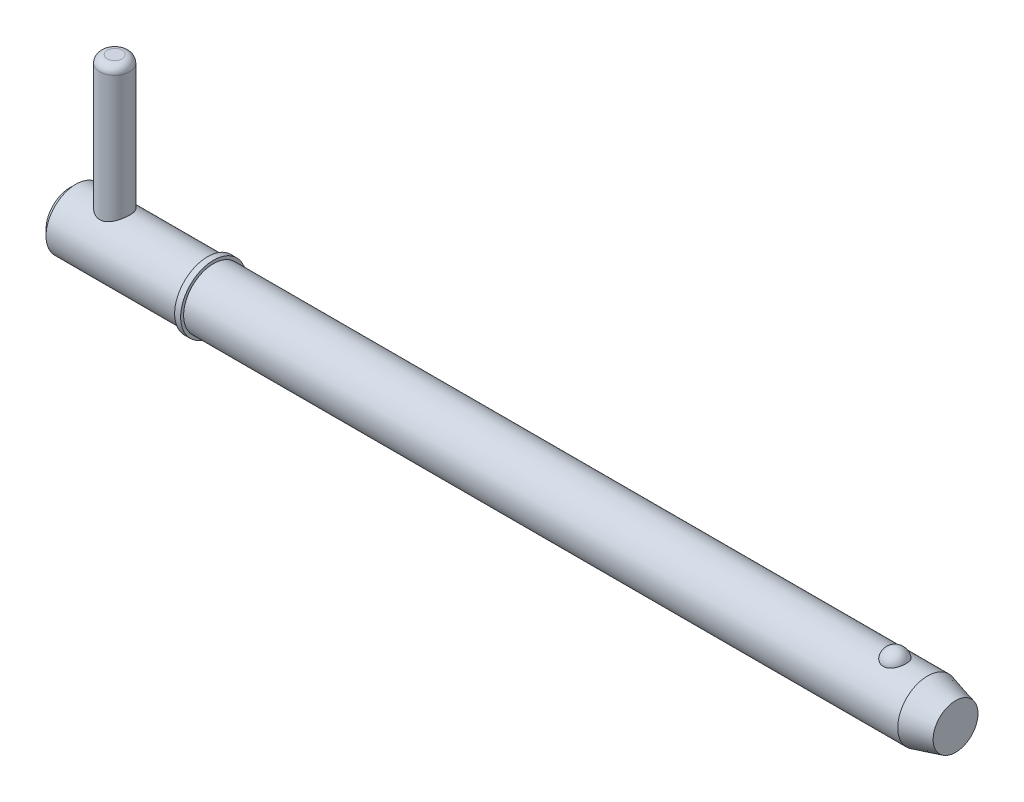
ISO-10303-21;
HEADER;
FILE_DESCRIPTION(('STEP AP214'),'2;1');
FILE_NAME('part.step','',(''),(''),'','','');
FILE_SCHEMA(('AUTOMOTIVE_DESIGN { 1 0 10303 214 1 1 1 1 }'));
ENDSEC;
DATA;
#1=APPLICATION_CONTEXT('core data for automotive mechanical design processes');
#2=APPLICATION_PROTOCOL_DEFINITION('international standard','automotive_design',2000,#1);
#3=PRODUCT_CONTEXT('',#1,'mechanical');
#4=PRODUCT('Part','Part','',(#3));
#5=PRODUCT_RELATED_PRODUCT_CATEGORY('part','',(#4));
#6=PRODUCT_DEFINITION_FORMATION('','',#4);
#7=PRODUCT_DEFINITION_CONTEXT('part definition',#1,'design');
#8=PRODUCT_DEFINITION('design','',#6,#7);
#9=PRODUCT_DEFINITION_SHAPE('','',#8);
#10=(LENGTH_UNIT() NAMED_UNIT(*) SI_UNIT(.MILLI.,.METRE.));
#11=(NAMED_UNIT(*) PLANE_ANGLE_UNIT() SI_UNIT($,.RADIAN.));
#12=(NAMED_UNIT(*) SI_UNIT($,.STERADIAN.) SOLID_ANGLE_UNIT());
#13=UNCERTAINTY_MEASURE_WITH_UNIT(LENGTH_MEASURE(1.E-05),#10,'distance_accuracy_value','');
#14=(GEOMETRIC_REPRESENTATION_CONTEXT(3) GLOBAL_UNCERTAINTY_ASSIGNED_CONTEXT((#13)) GLOBAL_UNIT_ASSIGNED_CONTEXT((#10,
#11,#12)) REPRESENTATION_CONTEXT('',''));
#15=CARTESIAN_POINT('',(0.,0.,0.));
#16=DIRECTION('',(0.,0.,1.));
#17=DIRECTION('',(1.,0.,0.));
#18=AXIS2_PLACEMENT_3D('',#15,#16,#17);
#19=CARTESIAN_POINT('',(5.94,21.43,0.));
#20=DIRECTION('',(0.,-1.,0.));
#21=DIRECTION('',(0.,0.,-1.));
#22=AXIS2_PLACEMENT_3D('',#19,#20,#21);
#23=CYLINDRICAL_SURFACE('',#22,1.98);
#24=CARTESIAN_POINT('',(5.94,-2.98,0.));
#25=DIRECTION('',(0.,1.,0.));
#26=DIRECTION('',(0.,0.,1.));
#27=AXIS2_PLACEMENT_3D('',#24,#25,#26);
#28=CIRCLE('',#27,1.98);
#29=CARTESIAN_POINT('',(5.94,-2.98,1.98));
#30=VERTEX_POINT('',#29);
#31=EDGE_CURVE('P0_E25',#30,#30,#28,.T.);
#32=ORIENTED_EDGE('',*,*,#31,.T.);
#33=EDGE_LOOP('',(#32));
#34=FACE_BOUND('',#33,.T.);
#35=CARTESIAN_POINT('',(5.94,20.44,0.));
#36=DIRECTION('',(0.,1.,0.));
#37=DIRECTION('',(0.,0.,1.));
#38=AXIS2_PLACEMENT_3D('',#35,#36,#37);
#39=CIRCLE('',#38,1.98);
#40=CARTESIAN_POINT('',(5.94,20.44,1.98));
#41=VERTEX_POINT('',#40);
#42=EDGE_CURVE('P0_E29',#41,#41,#39,.F.);
#43=ORIENTED_EDGE('',*,*,#42,.T.);
#44=EDGE_LOOP('',(#43));
#45=FACE_BOUND('',#44,.T.);
#46=ADVANCED_FACE('P0_F14',(#34,#45),#23,.T.);
#47=CARTESIAN_POINT('',(5.94,21.43,0.));
#48=DIRECTION('',(0.,1.,0.));
#49=DIRECTION('',(0.,0.,1.));
#50=AXIS2_PLACEMENT_3D('',#47,#48,#49);
#51=PLANE('',#50);
#52=CARTESIAN_POINT('',(5.94,21.43,0.));
#53=DIRECTION('',(0.,1.,0.));
#54=DIRECTION('',(0.,0.,1.));
#55=AXIS2_PLACEMENT_3D('',#52,#53,#54);
#56=CIRCLE('',#55,0.99);
#57=CARTESIAN_POINT('',(5.94,21.43,0.99));
#58=VERTEX_POINT('',#57);
#59=EDGE_CURVE('P0_E10',#58,#58,#56,.T.);
#60=ORIENTED_EDGE('',*,*,#59,.T.);
#61=EDGE_LOOP('',(#60));
#62=FACE_BOUND('',#61,.T.);
#63=ADVANCED_FACE('P0_F46',(#62),#51,.T.);
#64=CARTESIAN_POINT('',(5.94,-3.97,0.));
#65=DIRECTION('',(0.,1.,0.));
#66=DIRECTION('',(0.,0.,1.));
#67=AXIS2_PLACEMENT_3D('',#64,#65,#66);
#68=PLANE('',#67);
#69=CARTESIAN_POINT('',(5.94,-3.97,0.));
#70=DIRECTION('',(0.,1.,0.));
#71=DIRECTION('',(0.,0.,1.));
#72=AXIS2_PLACEMENT_3D('',#69,#70,#71);
#73=CIRCLE('',#72,0.99);
#74=CARTESIAN_POINT('',(5.94,-3.97,0.99));
#75=VERTEX_POINT('',#74);
#76=EDGE_CURVE('P0_E21',#75,#75,#73,.F.);
#77=ORIENTED_EDGE('',*,*,#76,.T.);
#78=EDGE_LOOP('',(#77));
#79=FACE_BOUND('',#78,.T.);
#80=ADVANCED_FACE('P0_F43',(#79),#68,.F.);
#81=CARTESIAN_POINT('',(5.94,-2.98,0.));
#82=DIRECTION('',(0.,1.,0.));
#83=DIRECTION('',(0.,0.,1.));
#84=AXIS2_PLACEMENT_3D('',#81,#82,#83);
#85=DEGENERATE_TOROIDAL_SURFACE('',#84,0.99,0.99,.T.);
#86=ORIENTED_EDGE('',*,*,#76,.F.);
#87=EDGE_LOOP('',(#86));
#88=FACE_BOUND('',#87,.T.);
#89=ORIENTED_EDGE('',*,*,#31,.F.);
#90=EDGE_LOOP('',(#89));
#91=FACE_BOUND('',#90,.T.);
#92=ADVANCED_FACE('P0_F38',(#88,#91),#85,.T.);
#93=CARTESIAN_POINT('',(5.94,20.44,0.));
#94=DIRECTION('',(0.,1.,0.));
#95=DIRECTION('',(0.,0.,1.));
#96=AXIS2_PLACEMENT_3D('',#93,#94,#95);
#97=DEGENERATE_TOROIDAL_SURFACE('',#96,0.99,0.99,.T.);
#98=ORIENTED_EDGE('',*,*,#42,.F.);
#99=EDGE_LOOP('',(#98));
#100=FACE_BOUND('',#99,.T.);
#101=ORIENTED_EDGE('',*,*,#59,.F.);
#102=EDGE_LOOP('',(#101));
#103=FACE_BOUND('',#102,.T.);
#104=ADVANCED_FACE('P0_F16',(#100,#103),#97,.T.);
#105=CLOSED_SHELL('',(#46,#63,#80,#92,#104));
#106=MANIFOLD_SOLID_BREP('P0_B1',#105);
#107=CARTESIAN_POINT('',(0.,0.,0.));
#108=DIRECTION('',(1.,0.,0.));
#109=DIRECTION('',(0.,0.,-1.));
#110=AXIS2_PLACEMENT_3D('',#107,#108,#109);
#111=CYLINDRICAL_SURFACE('',#110,3.97);
#112=CARTESIAN_POINT('',(113.775939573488,0.,0.));
#113=DIRECTION('',(1.,0.,0.));
#114=DIRECTION('',(0.,0.,-1.));
#115=AXIS2_PLACEMENT_3D('',#112,#113,#114);
#116=CIRCLE('',#115,3.97);
#117=CARTESIAN_POINT('',(113.775939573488,0.,-3.97));
#118=VERTEX_POINT('',#117);
#119=EDGE_CURVE('P1_E81',#118,#118,#116,.T.);
#120=ORIENTED_EDGE('',*,*,#119,.F.);
#121=EDGE_LOOP('',(#120));
#122=FACE_BOUND('',#121,.T.);
#123=CARTESIAN_POINT('',(19.05,0.,0.));
#124=DIRECTION('',(1.,0.,0.));
#125=DIRECTION('',(0.,0.,-1.));
#126=AXIS2_PLACEMENT_3D('',#123,#124,#125);
#127=CIRCLE('',#126,3.97);
#128=CARTESIAN_POINT('',(19.05,0.,-3.97));
#129=VERTEX_POINT('',#128);
#130=EDGE_CURVE('P1_E85',#129,#129,#127,.T.);
#131=ORIENTED_EDGE('',*,*,#130,.T.);
#132=EDGE_LOOP('',(#131));
#133=FACE_BOUND('',#132,.T.);
#134=CARTESIAN_POINT('',(109.445192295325,3.65715365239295,1.54470941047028));
#135=CARTESIAN_POINT('',(109.365244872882,3.65716001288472,1.54470290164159));
#136=CARTESIAN_POINT('',(109.285165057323,3.65987074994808,1.53832549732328));
#137=CARTESIAN_POINT('',(109.127237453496,3.6704221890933,1.51297018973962));
#138=CARTESIAN_POINT('',(109.04939614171,3.67827646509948,1.49395894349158));
#139=CARTESIAN_POINT('',(108.898461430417,3.69818848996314,1.44395950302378));
#140=CARTESIAN_POINT('',(108.825356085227,3.71023513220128,1.41300293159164));
#141=CARTESIAN_POINT('',(108.685563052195,3.73721833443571,1.34000212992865));
#142=CARTESIAN_POINT('',(108.618872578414,3.75215363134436,1.2979627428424));
#143=CARTESIAN_POINT('',(108.49148864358,3.78384968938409,1.20248834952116));
#144=CARTESIAN_POINT('',(108.431029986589,3.80065129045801,1.14875388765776));
#145=CARTESIAN_POINT('',(108.319694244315,3.83398532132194,1.03205417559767));
#146=CARTESIAN_POINT('',(108.268820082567,3.85051766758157,0.969086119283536));
#147=CARTESIAN_POINT('',(108.175632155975,3.88238608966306,0.832526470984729));
#148=CARTESIAN_POINT('',(108.133796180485,3.89763698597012,0.758588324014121));
#149=CARTESIAN_POINT('',(108.06251087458,3.92451063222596,0.60435211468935));
#150=CARTESIAN_POINT('',(108.033062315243,3.93613315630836,0.524053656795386));
#151=CARTESIAN_POINT('',(107.986892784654,3.95467606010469,0.358403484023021));
#152=CARTESIAN_POINT('',(107.970312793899,3.96154426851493,0.273006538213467));
#153=CARTESIAN_POINT('',(107.950756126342,3.96967008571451,0.100408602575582));
#154=CARTESIAN_POINT('',(107.947778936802,3.97092790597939,0.0132076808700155));
#155=CARTESIAN_POINT('',(107.955458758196,3.96771794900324,-0.159844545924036));
#156=CARTESIAN_POINT('',(107.966016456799,3.96329187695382,-0.245701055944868));
#157=CARTESIAN_POINT('',(108.00038009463,3.94923163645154,-0.41427746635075));
#158=CARTESIAN_POINT('',(108.024186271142,3.93959737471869,-0.496997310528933));
#159=CARTESIAN_POINT('',(108.08461142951,3.91607752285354,-0.657113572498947));
#160=CARTESIAN_POINT('',(108.121249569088,3.90218558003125,-0.734501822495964));
#161=CARTESIAN_POINT('',(108.206593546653,3.87158287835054,-0.881704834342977));
#162=CARTESIAN_POINT('',(108.255300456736,3.8548718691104,-0.951518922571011));
#163=CARTESIAN_POINT('',(108.364116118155,3.82028735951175,-1.08208159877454));
#164=CARTESIAN_POINT('',(108.424295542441,3.80240713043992,-1.14276958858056));
#165=CARTESIAN_POINT('',(108.554493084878,3.76758161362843,-1.2528243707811));
#166=CARTESIAN_POINT('',(108.624510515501,3.75063626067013,-1.30219195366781));
#167=CARTESIAN_POINT('',(108.77118160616,3.71998948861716,-1.38729709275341));
#168=CARTESIAN_POINT('',(108.847681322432,3.70623183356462,-1.42327904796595));
#169=CARTESIAN_POINT('',(109.006298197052,3.68323188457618,-1.48178996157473));
#170=CARTESIAN_POINT('',(109.0884132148,3.67398788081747,-1.5043240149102));
#171=CARTESIAN_POINT('',(109.251481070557,3.6615216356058,-1.53440939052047));
#172=CARTESIAN_POINT('',(109.332284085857,3.65801951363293,-1.54265826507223));
#173=CARTESIAN_POINT('',(109.49420850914,3.65657341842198,-1.54608423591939));
#174=CARTESIAN_POINT('',(109.575329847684,3.65862829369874,-1.54126404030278));
#175=CARTESIAN_POINT('',(109.732812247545,3.66788969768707,-1.51908474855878));
#176=CARTESIAN_POINT('',(109.809242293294,3.67492621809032,-1.50213925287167));
#177=CARTESIAN_POINT('',(109.958041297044,3.69318404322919,-1.45666982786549));
#178=CARTESIAN_POINT('',(110.030409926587,3.70440568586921,-1.42814496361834));
#179=CARTESIAN_POINT('',(110.170802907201,3.73012749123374,-1.35956319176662));
#180=CARTESIAN_POINT('',(110.238700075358,3.74469307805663,-1.31927107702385));
#181=CARTESIAN_POINT('',(110.366864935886,3.77545272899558,-1.22847440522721));
#182=CARTESIAN_POINT('',(110.427130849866,3.79164717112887,-1.17796747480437));
#183=CARTESIAN_POINT('',(110.541634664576,3.82490325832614,-1.06519260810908));
#184=CARTESIAN_POINT('',(110.595413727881,3.84196735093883,-1.00245914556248));
#185=CARTESIAN_POINT('',(110.692098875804,3.87439863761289,-0.868715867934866));
#186=CARTESIAN_POINT('',(110.735003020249,3.88976552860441,-0.797704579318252));
#187=CARTESIAN_POINT('',(110.810266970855,3.91771381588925,-0.646896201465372));
#188=CARTESIAN_POINT('',(110.84225322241,3.93019255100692,-0.566893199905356));
#189=CARTESIAN_POINT('',(110.893110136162,3.95043886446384,-0.402255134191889));
#190=CARTESIAN_POINT('',(110.911980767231,3.95820643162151,-0.317620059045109));
#191=CARTESIAN_POINT('',(110.93621625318,3.96823733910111,-0.146156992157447));
#192=CARTESIAN_POINT('',(110.941587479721,3.970503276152,-0.0593300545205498));
#193=CARTESIAN_POINT('',(110.938730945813,3.96930811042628,0.114057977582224));
#194=CARTESIAN_POINT('',(110.930503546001,3.9658471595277,0.200619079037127));
#195=CARTESIAN_POINT('',(110.900706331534,3.95358562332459,0.370506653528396));
#196=CARTESIAN_POINT('',(110.87921294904,3.94481563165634,0.453848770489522));
#197=CARTESIAN_POINT('',(110.82338397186,3.92284586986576,0.615497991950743));
#198=CARTESIAN_POINT('',(110.789047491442,3.90964579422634,0.693804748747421));
#199=CARTESIAN_POINT('',(110.707970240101,3.88006987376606,0.843703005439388));
#200=CARTESIAN_POINT('',(110.661153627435,3.86367478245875,0.915249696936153));
#201=CARTESIAN_POINT('',(110.556189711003,3.82949741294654,1.04910810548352));
#202=CARTESIAN_POINT('',(110.498042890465,3.81171519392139,1.11142021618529));
#203=CARTESIAN_POINT('',(110.371743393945,3.77673366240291,1.22503948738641));
#204=CARTESIAN_POINT('',(110.303597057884,3.75953398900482,1.27635357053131));
#205=CARTESIAN_POINT('',(110.158900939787,3.72770506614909,1.36653336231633));
#206=CARTESIAN_POINT('',(110.082348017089,3.71307678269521,1.40539439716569));
#207=CARTESIAN_POINT('',(109.925759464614,3.68864287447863,1.46830480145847));
#208=CARTESIAN_POINT('',(109.845930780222,3.67869017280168,1.49281289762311));
#209=CARTESIAN_POINT('',(109.682987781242,3.66414535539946,1.52817474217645));
#210=CARTESIAN_POINT('',(109.599884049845,3.65953723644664,1.53906926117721));
#211=CARTESIAN_POINT('',(109.492776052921,3.6573894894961,1.54414878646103));
#212=CARTESIAN_POINT('',(109.468990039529,3.65715175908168,1.54471134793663));
#213=CARTESIAN_POINT('',(109.445192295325,3.65715365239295,1.54470941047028));
#214=B_SPLINE_CURVE_WITH_KNOTS('',3,(#134,#135,#136,#137,#138,#139,#140,#141,#142,#143,#144,
#145,#146,#147,#148,#149,#150,#151,#152,#153,#154,#155,#156,#157,#158,#159,#160,#161,#162,#163,
#164,#165,#166,#167,#168,#169,#170,#171,#172,#173,#174,#175,#176,#177,#178,#179,#180,#181,#182,
#183,#184,#185,#186,#187,#188,#189,#190,#191,#192,#193,#194,#195,#196,#197,#198,#199,#200,#201,
#202,#203,#204,#205,#206,#207,#208,#209,#210,#211,#212,#213),.UNSPECIFIED.,.T.,.F.,(4,2,2,2,2,2,
2,2,2,2,2,2,2,2,2,2,2,2,2,2,2,2,2,2,2,2,2,2,2,2,2,2,2,2,2,2,2,2,2,4),(0.,0.239777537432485,
0.480190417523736,0.719971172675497,0.959647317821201,1.20639040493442,1.45320863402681,
1.7109367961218,1.96868099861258,2.22921052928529,2.48973023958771,2.74834928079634,
3.00697295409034,3.26598440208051,3.52501886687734,3.78570385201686,4.04637062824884,
4.30201257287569,4.5575576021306,4.80022994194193,5.04285200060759,5.27757006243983,
5.51230707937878,5.75210128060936,5.99195126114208,6.24392810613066,6.49594987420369,
6.75588818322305,7.01582710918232,7.27564332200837,7.53545264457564,7.79377886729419,
8.0521229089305,8.31207418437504,8.57201437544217,8.83179046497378,9.09166393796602,
9.34270057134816,9.59298357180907,9.66435753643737),.UNSPECIFIED.);
#215=CARTESIAN_POINT('',(109.445192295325,3.65715365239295,1.54470941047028));
#216=VERTEX_POINT('',#215);
#217=EDGE_CURVE('P1_E35',#216,#216,#214,.T.);
#218=ORIENTED_EDGE('',*,*,#217,.T.);
#219=EDGE_LOOP('',(#218));
#220=FACE_BOUND('',#219,.T.);
#221=ADVANCED_FACE('P1_F13',(#122,#133,#220),#111,.T.);
#222=CARTESIAN_POINT('',(0.,0.,0.));
#223=DIRECTION('',(-1.,0.,0.));
#224=DIRECTION('',(0.,0.,1.));
#225=AXIS2_PLACEMENT_3D('',#222,#223,#224);
#226=PLANE('',#225);
#227=CARTESIAN_POINT('',(0.,0.,0.));
#228=DIRECTION('',(1.,0.,0.));
#229=DIRECTION('',(0.,0.,-1.));
#230=AXIS2_PLACEMENT_3D('',#227,#228,#229);
#231=CIRCLE('',#230,3.176);
#232=CARTESIAN_POINT('',(0.,0.,-3.176));
#233=VERTEX_POINT('',#232);
#234=EDGE_CURVE('P1_E9',#233,#233,#231,.T.);
#235=ORIENTED_EDGE('',*,*,#234,.F.);
#236=EDGE_LOOP('',(#235));
#237=FACE_BOUND('',#236,.T.);
#238=ADVANCED_FACE('P1_F15',(#237),#226,.T.);
#239=CARTESIAN_POINT('',(0.793999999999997,0.,0.));
#240=DIRECTION('',(1.,0.,0.));
#241=DIRECTION('',(0.,0.,-1.));
#242=AXIS2_PLACEMENT_3D('',#239,#240,#241);
#243=CONICAL_SURFACE('',#242,3.97,0.78539816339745);
#244=ORIENTED_EDGE('',*,*,#234,.T.);
#245=EDGE_LOOP('',(#244));
#246=FACE_BOUND('',#245,.T.);
#247=CARTESIAN_POINT('',(0.793999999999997,0.,0.));
#248=DIRECTION('',(1.,0.,0.));
#249=DIRECTION('',(0.,0.,-1.));
#250=AXIS2_PLACEMENT_3D('',#247,#248,#249);
#251=CIRCLE('',#250,3.97);
#252=CARTESIAN_POINT('',(0.793999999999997,0.,-3.97));
#253=VERTEX_POINT('',#252);
#254=EDGE_CURVE('P1_E26',#253,#253,#251,.T.);
#255=ORIENTED_EDGE('',*,*,#254,.F.);
#256=EDGE_LOOP('',(#255));
#257=FACE_BOUND('',#256,.T.);
#258=ADVANCED_FACE('P1_F77',(#246,#257),#243,.T.);
#259=CARTESIAN_POINT('',(0.,0.,0.));
#260=DIRECTION('',(1.,0.,0.));
#261=DIRECTION('',(0.,0.,-1.));
#262=AXIS2_PLACEMENT_3D('',#259,#260,#261);
#263=CYLINDRICAL_SURFACE('',#262,3.97);
#264=CARTESIAN_POINT('',(5.94,-3.44100276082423,1.98));
#265=CARTESIAN_POINT('',(5.8367885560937,-3.44101282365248,1.97999171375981));
#266=CARTESIAN_POINT('',(5.73344176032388,-3.44571749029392,1.97187534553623));
#267=CARTESIAN_POINT('',(5.52991905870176,-3.46385873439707,1.93981946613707));
#268=CARTESIAN_POINT('',(5.42975031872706,-3.47731375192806,1.91584653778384));
#269=CARTESIAN_POINT('',(5.23590869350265,-3.51100678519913,1.85336773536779));
#270=CARTESIAN_POINT('',(5.14220446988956,-3.53120882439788,1.81493880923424));
#271=CARTESIAN_POINT('',(4.9625969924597,-3.57606420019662,1.72487335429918));
#272=CARTESIAN_POINT('',(4.87669412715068,-3.6007177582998,1.67323616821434));
#273=CARTESIAN_POINT('',(4.70734412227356,-3.65417020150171,1.55325205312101));
#274=CARTESIAN_POINT('',(4.62467662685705,-3.68314323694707,1.4838818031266));
#275=CARTESIAN_POINT('',(4.47154355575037,-3.74056406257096,1.33252902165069));
#276=CARTESIAN_POINT('',(4.40108404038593,-3.76901158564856,1.25054026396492));
#277=CARTESIAN_POINT('',(4.26974803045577,-3.82445556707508,1.06956584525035));
#278=CARTESIAN_POINT('',(4.20982960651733,-3.8512271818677,0.969809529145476));
#279=CARTESIAN_POINT('',(4.10798077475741,-3.89804342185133,0.760047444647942));
#280=CARTESIAN_POINT('',(4.06603907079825,-3.91809226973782,0.650048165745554));
#281=CARTESIAN_POINT('',(4.00441878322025,-3.94794912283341,0.431181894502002));
#282=CARTESIAN_POINT('',(3.98337329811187,-3.95838209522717,0.322786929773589));
#283=CARTESIAN_POINT('',(3.9596425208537,-3.97016407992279,0.103541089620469));
#284=CARTESIAN_POINT('',(3.95694618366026,-3.97151855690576,-0.00730826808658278));
#285=CARTESIAN_POINT('',(3.9694599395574,-3.96528826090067,-0.218044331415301));
#286=CARTESIAN_POINT('',(3.98314071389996,-3.95846689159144,-0.318049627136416));
#287=CARTESIAN_POINT('',(4.02528522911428,-3.93780347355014,-0.514124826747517));
#288=CARTESIAN_POINT('',(4.05375007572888,-3.92396089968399,-0.61019443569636));
#289=CARTESIAN_POINT('',(4.12484256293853,-3.89028355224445,-0.797351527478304));
#290=CARTESIAN_POINT('',(4.16766142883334,-3.87036821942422,-0.888351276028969));
#291=CARTESIAN_POINT('',(4.26598377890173,-3.82634285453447,-1.06209448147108));
#292=CARTESIAN_POINT('',(4.32149181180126,-3.8022313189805,-1.14483496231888));
#293=CARTESIAN_POINT('',(4.44962332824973,-3.74940011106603,-1.30802500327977));
#294=CARTESIAN_POINT('',(4.52336636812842,-3.72046031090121,-1.38752498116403));
#295=CARTESIAN_POINT('',(4.68287656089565,-3.66269463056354,-1.53354043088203));
#296=CARTESIAN_POINT('',(4.7686527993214,-3.63386885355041,-1.60004599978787));
#297=CARTESIAN_POINT('',(4.9564069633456,-3.57763161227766,-1.72228426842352));
#298=CARTESIAN_POINT('',(5.05906485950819,-3.5504233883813,-1.77707534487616));
#299=CARTESIAN_POINT('',(5.27381412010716,-3.50334038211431,-1.86819784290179));
#300=CARTESIAN_POINT('',(5.38589553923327,-3.48345798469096,-1.90454844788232));
#301=CARTESIAN_POINT('',(5.6069795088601,-3.45548331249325,-1.95481643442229));
#302=CARTESIAN_POINT('',(5.71552407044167,-3.44658268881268,-1.97028113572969));
#303=CARTESIAN_POINT('',(5.93399639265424,-3.43928114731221,-1.98300600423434));
#304=CARTESIAN_POINT('',(6.04392313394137,-3.44087289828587,-1.98027888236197));
#305=CARTESIAN_POINT('',(6.24931618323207,-3.45351901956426,-1.95811780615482));
#306=CARTESIAN_POINT('',(6.34505668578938,-3.46352725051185,-1.94052989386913));
#307=CARTESIAN_POINT('',(6.53204702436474,-3.49033612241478,-1.89188242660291));
#308=CARTESIAN_POINT('',(6.62329540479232,-3.50713894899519,-1.86081853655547));
#309=CARTESIAN_POINT('',(6.80352105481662,-3.54655680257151,-1.78458666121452));
#310=CARTESIAN_POINT('',(6.89219712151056,-3.56940508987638,-1.73883178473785));
#311=CARTESIAN_POINT('',(7.06112449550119,-3.61813012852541,-1.63502913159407));
#312=CARTESIAN_POINT('',(7.14137144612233,-3.6440084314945,-1.57697504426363));
#313=CARTESIAN_POINT('',(7.30168083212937,-3.69977514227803,-1.44171920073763));
#314=CARTESIAN_POINT('',(7.38046039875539,-3.7297597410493,-1.36302972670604));
#315=CARTESIAN_POINT('',(7.52409649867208,-3.78754991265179,-1.19307190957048));
#316=CARTESIAN_POINT('',(7.58894840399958,-3.81535475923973,-1.10179940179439));
#317=CARTESIAN_POINT('',(7.70430122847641,-3.86658972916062,-0.906019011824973));
#318=CARTESIAN_POINT('',(7.75438714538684,-3.88988795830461,-0.801229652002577));
#319=CARTESIAN_POINT('',(7.83572184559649,-3.92848199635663,-0.583216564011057));
#320=CARTESIAN_POINT('',(7.86698708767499,-3.94378479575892,-0.470000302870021));
#321=CARTESIAN_POINT('',(7.90711051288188,-3.96355307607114,-0.249525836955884));
#322=CARTESIAN_POINT('',(7.91775648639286,-3.96888171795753,-0.142669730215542));
#323=CARTESIAN_POINT('',(7.92160247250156,-3.97079858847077,0.0714191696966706));
#324=CARTESIAN_POINT('',(7.91480852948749,-3.96738984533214,0.178651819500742));
#325=CARTESIAN_POINT('',(7.88515479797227,-3.9527181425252,0.383072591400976));
#326=CARTESIAN_POINT('',(7.8633739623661,-3.94198303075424,0.480459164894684));
#327=CARTESIAN_POINT('',(7.80581513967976,-3.91422178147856,0.670038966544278));
#328=CARTESIAN_POINT('',(7.77003513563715,-3.89719473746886,0.762231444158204));
#329=CARTESIAN_POINT('',(7.68389191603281,-3.85747818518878,0.943248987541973));
#330=CARTESIAN_POINT('',(7.63296879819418,-3.83457704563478,1.03175978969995));
#331=CARTESIAN_POINT('',(7.51869140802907,-3.7855122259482,1.19934744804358));
#332=CARTESIAN_POINT('',(7.45533142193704,-3.75934704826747,1.2784199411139));
#333=CARTESIAN_POINT('',(7.31068939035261,-3.70329841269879,1.433144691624));
#334=CARTESIAN_POINT('',(7.22825362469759,-3.67330340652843,1.50768183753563));
#335=CARTESIAN_POINT('',(7.05162367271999,-3.61514025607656,1.64226879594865));
#336=CARTESIAN_POINT('',(6.95741928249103,-3.58697372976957,1.70230590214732));
#337=CARTESIAN_POINT('',(6.75590859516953,-3.53504049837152,1.80775364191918));
#338=CARTESIAN_POINT('',(6.64828786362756,-3.51143624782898,1.85265616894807));
#339=CARTESIAN_POINT('',(6.48137774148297,-3.48289659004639,1.90544537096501));
#340=CARTESIAN_POINT('',(6.42488151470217,-3.4745323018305,1.9206071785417));
#341=CARTESIAN_POINT('',(6.31046920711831,-3.4604244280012,1.94591259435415));
#342=CARTESIAN_POINT('',(6.25255415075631,-3.45467900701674,1.95605971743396));
#343=CARTESIAN_POINT('',(6.1521444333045,-3.44728060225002,1.96905939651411));
#344=CARTESIAN_POINT('',(6.10985721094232,-3.44493297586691,1.97315742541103));
#345=CARTESIAN_POINT('',(6.02505433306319,-3.44179192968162,1.97862952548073));
#346=CARTESIAN_POINT('',(5.98253866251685,-3.44099861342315,1.98000341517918));
#347=CARTESIAN_POINT('',(5.94,-3.44100276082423,1.98));
#348=B_SPLINE_CURVE_WITH_KNOTS('',3,(#264,#265,#266,#267,#268,#269,#270,#271,#272,#273,#274,
#275,#276,#277,#278,#279,#280,#281,#282,#283,#284,#285,#286,#287,#288,#289,#290,#291,#292,#293,
#294,#295,#296,#297,#298,#299,#300,#301,#302,#303,#304,#305,#306,#307,#308,#309,#310,#311,#312,
#313,#314,#315,#316,#317,#318,#319,#320,#321,#322,#323,#324,#325,#326,#327,#328,#329,#330,#331,
#332,#333,#334,#335,#336,#337,#338,#339,#340,#341,#342,#343,#344,#345,#346,#347),.UNSPECIFIED.,
.T.,.F.,(4,2,2,2,2,2,2,2,2,2,2,2,2,2,2,2,2,2,2,2,2,2,2,2,2,2,2,2,2,2,2,2,2,2,2,2,2,2,2,2,2,4),
(0.,0.309462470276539,0.619579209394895,0.928068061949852,1.23657226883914,1.57038619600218,
1.90436536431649,2.26071614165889,2.61684266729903,2.94773555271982,3.27842924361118,
3.58050679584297,3.88260694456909,4.18890317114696,4.49530936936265,4.83057163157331,
5.1660884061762,5.52272472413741,5.87898927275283,6.20706708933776,6.53491569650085,
6.82716910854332,7.11951660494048,7.42541184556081,7.73146442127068,8.07586334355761,
8.42037652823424,8.77380887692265,9.12693169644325,9.44775848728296,9.76847409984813,
10.0682302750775,10.3680296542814,10.6806938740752,10.9935020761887,11.3373031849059,
11.6814044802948,12.0361164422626,12.2131519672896,12.3900632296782,12.5175998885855,
12.6451450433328),.UNSPECIFIED.);
#349=CARTESIAN_POINT('',(5.94,-3.44100276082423,1.98));
#350=VERTEX_POINT('',#349);
#351=EDGE_CURVE('P1_E17',#350,#350,#348,.T.);
#352=ORIENTED_EDGE('',*,*,#351,.F.);
#353=EDGE_LOOP('',(#352));
#354=FACE_BOUND('',#353,.T.);
#355=CARTESIAN_POINT('',(5.94,3.44100276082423,1.98));
#356=CARTESIAN_POINT('',(6.0432114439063,3.44101282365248,1.97999171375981));
#357=CARTESIAN_POINT('',(6.14655823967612,3.44571749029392,1.97187534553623));
#358=CARTESIAN_POINT('',(6.35008094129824,3.46385873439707,1.93981946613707));
#359=CARTESIAN_POINT('',(6.45024968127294,3.47731375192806,1.91584653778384));
#360=CARTESIAN_POINT('',(6.64409130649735,3.51100678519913,1.85336773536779));
#361=CARTESIAN_POINT('',(6.73779553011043,3.53120882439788,1.81493880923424));
#362=CARTESIAN_POINT('',(6.91740300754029,3.57606420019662,1.72487335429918));
#363=CARTESIAN_POINT('',(7.00330587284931,3.6007177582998,1.67323616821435));
#364=CARTESIAN_POINT('',(7.17265587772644,3.65417020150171,1.55325205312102));
#365=CARTESIAN_POINT('',(7.25532337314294,3.68314323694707,1.4838818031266));
#366=CARTESIAN_POINT('',(7.40845644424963,3.74056406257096,1.3325290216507));
#367=CARTESIAN_POINT('',(7.47891595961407,3.76901158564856,1.25054026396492));
#368=CARTESIAN_POINT('',(7.61025196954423,3.82445556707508,1.06956584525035));
#369=CARTESIAN_POINT('',(7.67017039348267,3.8512271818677,0.969809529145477));
#370=CARTESIAN_POINT('',(7.77201922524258,3.89804342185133,0.760047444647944));
#371=CARTESIAN_POINT('',(7.81396092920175,3.91809226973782,0.650048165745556));
#372=CARTESIAN_POINT('',(7.87558121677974,3.94794912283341,0.431181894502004));
#373=CARTESIAN_POINT('',(7.89662670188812,3.95838209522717,0.322786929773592));
#374=CARTESIAN_POINT('',(7.9203574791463,3.97016407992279,0.103541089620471));
#375=CARTESIAN_POINT('',(7.92305381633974,3.97151855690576,-0.00730826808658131));
#376=CARTESIAN_POINT('',(7.9105400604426,3.96528826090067,-0.2180443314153));
#377=CARTESIAN_POINT('',(7.89685928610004,3.95846689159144,-0.318049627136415));
#378=CARTESIAN_POINT('',(7.85471477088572,3.93780347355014,-0.514124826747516));
#379=CARTESIAN_POINT('',(7.82624992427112,3.92396089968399,-0.61019443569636));
#380=CARTESIAN_POINT('',(7.75515743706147,3.89028355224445,-0.797351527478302));
#381=CARTESIAN_POINT('',(7.71233857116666,3.87036821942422,-0.888351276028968));
#382=CARTESIAN_POINT('',(7.61401622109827,3.82634285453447,-1.06209448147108));
#383=CARTESIAN_POINT('',(7.55850818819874,3.8022313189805,-1.14483496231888));
#384=CARTESIAN_POINT('',(7.43037667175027,3.74940011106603,-1.30802500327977));
#385=CARTESIAN_POINT('',(7.35663363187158,3.72046031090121,-1.38752498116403));
#386=CARTESIAN_POINT('',(7.19712343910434,3.66269463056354,-1.53354043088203));
#387=CARTESIAN_POINT('',(7.1113472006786,3.63386885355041,-1.60004599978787));
#388=CARTESIAN_POINT('',(6.9235930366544,3.57763161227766,-1.72228426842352));
#389=CARTESIAN_POINT('',(6.82093514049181,3.5504233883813,-1.77707534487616));
#390=CARTESIAN_POINT('',(6.60618587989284,3.50334038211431,-1.86819784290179));
#391=CARTESIAN_POINT('',(6.49410446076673,3.48345798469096,-1.90454844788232));
#392=CARTESIAN_POINT('',(6.2730204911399,3.45548331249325,-1.95481643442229));
#393=CARTESIAN_POINT('',(6.16447592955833,3.44658268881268,-1.97028113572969));
#394=CARTESIAN_POINT('',(5.94600360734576,3.43928114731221,-1.98300600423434));
#395=CARTESIAN_POINT('',(5.83607686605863,3.44087289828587,-1.98027888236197));
#396=CARTESIAN_POINT('',(5.63068381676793,3.45351901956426,-1.95811780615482));
#397=CARTESIAN_POINT('',(5.53494331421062,3.46352725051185,-1.94052989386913));
#398=CARTESIAN_POINT('',(5.34795297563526,3.49033612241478,-1.89188242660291));
#399=CARTESIAN_POINT('',(5.25670459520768,3.50713894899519,-1.86081853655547));
#400=CARTESIAN_POINT('',(5.07647894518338,3.54655680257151,-1.78458666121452));
#401=CARTESIAN_POINT('',(4.98780287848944,3.56940508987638,-1.73883178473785));
#402=CARTESIAN_POINT('',(4.81887550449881,3.61813012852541,-1.63502913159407));
#403=CARTESIAN_POINT('',(4.73862855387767,3.6440084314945,-1.57697504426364));
#404=CARTESIAN_POINT('',(4.57831916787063,3.69977514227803,-1.44171920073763));
#405=CARTESIAN_POINT('',(4.49953960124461,3.7297597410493,-1.36302972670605));
#406=CARTESIAN_POINT('',(4.35590350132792,3.78754991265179,-1.19307190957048));
#407=CARTESIAN_POINT('',(4.29105159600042,3.81535475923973,-1.10179940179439));
#408=CARTESIAN_POINT('',(4.17569877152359,3.86658972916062,-0.906019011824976));
#409=CARTESIAN_POINT('',(4.12561285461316,3.88988795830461,-0.80122965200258));
#410=CARTESIAN_POINT('',(4.04427815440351,3.92848199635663,-0.58321656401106));
#411=CARTESIAN_POINT('',(4.01301291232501,3.94378479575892,-0.470000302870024));
#412=CARTESIAN_POINT('',(3.97288948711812,3.96355307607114,-0.249525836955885));
#413=CARTESIAN_POINT('',(3.96224351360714,3.96888171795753,-0.142669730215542));
#414=CARTESIAN_POINT('',(3.95839752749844,3.97079858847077,0.0714191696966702));
#415=CARTESIAN_POINT('',(3.96519147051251,3.96738984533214,0.178651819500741));
#416=CARTESIAN_POINT('',(3.99484520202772,3.9527181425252,0.383072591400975));
#417=CARTESIAN_POINT('',(4.01662603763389,3.94198303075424,0.480459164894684));
#418=CARTESIAN_POINT('',(4.07418486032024,3.91422178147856,0.670038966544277));
#419=CARTESIAN_POINT('',(4.10996486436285,3.89719473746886,0.762231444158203));
#420=CARTESIAN_POINT('',(4.19610808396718,3.85747818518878,0.943248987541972));
#421=CARTESIAN_POINT('',(4.24703120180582,3.83457704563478,1.03175978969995));
#422=CARTESIAN_POINT('',(4.36130859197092,3.7855122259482,1.19934744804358));
#423=CARTESIAN_POINT('',(4.42466857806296,3.75934704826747,1.2784199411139));
#424=CARTESIAN_POINT('',(4.56931060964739,3.70329841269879,1.433144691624));
#425=CARTESIAN_POINT('',(4.65174637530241,3.67330340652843,1.50768183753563));
#426=CARTESIAN_POINT('',(4.82837632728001,3.61514025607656,1.64226879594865));
#427=CARTESIAN_POINT('',(4.92258071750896,3.58697372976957,1.70230590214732));
#428=CARTESIAN_POINT('',(5.12409140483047,3.53504049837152,1.80775364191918));
#429=CARTESIAN_POINT('',(5.23171213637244,3.51143624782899,1.85265616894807));
#430=CARTESIAN_POINT('',(5.39862225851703,3.48289659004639,1.90544537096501));
#431=CARTESIAN_POINT('',(5.45511848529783,3.4745323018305,1.9206071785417));
#432=CARTESIAN_POINT('',(5.56953079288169,3.4604244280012,1.94591259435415));
#433=CARTESIAN_POINT('',(5.62744584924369,3.45467900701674,1.95605971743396));
#434=CARTESIAN_POINT('',(5.7278555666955,3.44728060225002,1.9690593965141));
#435=CARTESIAN_POINT('',(5.77014278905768,3.44493297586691,1.97315742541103));
#436=CARTESIAN_POINT('',(5.85494566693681,3.44179192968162,1.97862952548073));
#437=CARTESIAN_POINT('',(5.89746133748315,3.44099861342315,1.98000341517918));
#438=CARTESIAN_POINT('',(5.94,3.44100276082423,1.98));
#439=B_SPLINE_CURVE_WITH_KNOTS('',3,(#355,#356,#357,#358,#359,#360,#361,#362,#363,#364,#365,
#366,#367,#368,#369,#370,#371,#372,#373,#374,#375,#376,#377,#378,#379,#380,#381,#382,#383,#384,
#385,#386,#387,#388,#389,#390,#391,#392,#393,#394,#395,#396,#397,#398,#399,#400,#401,#402,#403,
#404,#405,#406,#407,#408,#409,#410,#411,#412,#413,#414,#415,#416,#417,#418,#419,#420,#421,#422,
#423,#424,#425,#426,#427,#428,#429,#430,#431,#432,#433,#434,#435,#436,#437,#438),.UNSPECIFIED.,
.T.,.F.,(4,2,2,2,2,2,2,2,2,2,2,2,2,2,2,2,2,2,2,2,2,2,2,2,2,2,2,2,2,2,2,2,2,2,2,2,2,2,2,2,2,4),
(0.,0.309462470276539,0.619579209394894,0.928068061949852,1.23657226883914,1.57038619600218,
1.90436536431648,2.26071614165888,2.61684266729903,2.94773555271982,3.27842924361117,
3.58050679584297,3.88260694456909,4.18890317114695,4.49530936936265,4.83057163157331,
5.1660884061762,5.5227247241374,5.87898927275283,6.20706708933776,6.53491569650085,
6.82716910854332,7.11951660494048,7.42541184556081,7.73146442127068,8.07586334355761,
8.42037652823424,8.77380887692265,9.12693169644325,9.44775848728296,9.76847409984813,
10.0682302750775,10.3680296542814,10.6806938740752,10.9935020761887,11.3373031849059,
11.6814044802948,12.0361164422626,12.2131519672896,12.3900632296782,12.5175998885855,
12.6451450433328),.UNSPECIFIED.);
#440=CARTESIAN_POINT('',(5.94,3.44100276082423,1.98));
#441=VERTEX_POINT('',#440);
#442=EDGE_CURVE('P1_E43',#441,#441,#439,.T.);
#443=ORIENTED_EDGE('',*,*,#442,.F.);
#444=EDGE_LOOP('',(#443));
#445=FACE_BOUND('',#444,.T.);
#446=ORIENTED_EDGE('',*,*,#254,.T.);
#447=EDGE_LOOP('',(#446));
#448=FACE_BOUND('',#447,.T.);
#449=CARTESIAN_POINT('',(18.256,0.,0.));
#450=DIRECTION('',(1.,0.,0.));
#451=DIRECTION('',(0.,0.,-1.));
#452=AXIS2_PLACEMENT_3D('',#449,#450,#451);
#453=CIRCLE('',#452,3.97);
#454=CARTESIAN_POINT('',(18.256,0.,-3.97));
#455=VERTEX_POINT('',#454);
#456=EDGE_CURVE('P1_E31',#455,#455,#453,.T.);
#457=ORIENTED_EDGE('',*,*,#456,.F.);
#458=EDGE_LOOP('',(#457));
#459=FACE_BOUND('',#458,.T.);
#460=ADVANCED_FACE('P1_F103',(#354,#445,#448,#459),#263,.T.);
#461=CARTESIAN_POINT('',(18.256,3.97,0.));
#462=DIRECTION('',(-1.,0.,0.));
#463=DIRECTION('',(0.,0.,1.));
#464=AXIS2_PLACEMENT_3D('',#461,#462,#463);
#465=PLANE('',#464);
#466=ORIENTED_EDGE('',*,*,#456,.T.);
#467=EDGE_LOOP('',(#466));
#468=FACE_BOUND('',#467,.T.);
#469=CARTESIAN_POINT('',(18.256,0.,0.));
#470=DIRECTION('',(1.,0.,0.));
#471=DIRECTION('',(0.,0.,-1.));
#472=AXIS2_PLACEMENT_3D('',#469,#470,#471);
#473=CIRCLE('',#472,4.367);
#474=CARTESIAN_POINT('',(18.256,0.,-4.367));
#475=VERTEX_POINT('',#474);
#476=EDGE_CURVE('P1_E91',#475,#475,#473,.T.);
#477=ORIENTED_EDGE('',*,*,#476,.F.);
#478=EDGE_LOOP('',(#477));
#479=FACE_BOUND('',#478,.T.);
#480=ADVANCED_FACE('P1_F100',(#468,#479),#465,.T.);
#481=CARTESIAN_POINT('',(0.,0.,0.));
#482=DIRECTION('',(1.,0.,0.));
#483=DIRECTION('',(0.,0.,-1.));
#484=AXIS2_PLACEMENT_3D('',#481,#482,#483);
#485=CYLINDRICAL_SURFACE('',#484,4.367);
#486=ORIENTED_EDGE('',*,*,#476,.T.);
#487=EDGE_LOOP('',(#486));
#488=FACE_BOUND('',#487,.T.);
#489=CARTESIAN_POINT('',(19.05,0.,0.));
#490=DIRECTION('',(1.,0.,0.));
#491=DIRECTION('',(0.,0.,-1.));
#492=AXIS2_PLACEMENT_3D('',#489,#490,#491);
#493=CIRCLE('',#492,4.367);
#494=CARTESIAN_POINT('',(19.05,0.,-4.367));
#495=VERTEX_POINT('',#494);
#496=EDGE_CURVE('P1_E88',#495,#495,#493,.T.);
#497=ORIENTED_EDGE('',*,*,#496,.F.);
#498=EDGE_LOOP('',(#497));
#499=FACE_BOUND('',#498,.T.);
#500=ADVANCED_FACE('P1_F68',(#488,#499),#485,.T.);
#501=CARTESIAN_POINT('',(19.05,4.367,0.));
#502=DIRECTION('',(1.,0.,0.));
#503=DIRECTION('',(0.,0.,-1.));
#504=AXIS2_PLACEMENT_3D('',#501,#502,#503);
#505=PLANE('',#504);
#506=ORIENTED_EDGE('',*,*,#496,.T.);
#507=EDGE_LOOP('',(#506));
#508=FACE_BOUND('',#507,.T.);
#509=ORIENTED_EDGE('',*,*,#130,.F.);
#510=EDGE_LOOP('',(#509));
#511=FACE_BOUND('',#510,.T.);
#512=ADVANCED_FACE('P1_F62',(#508,#511),#505,.T.);
#513=CARTESIAN_POINT('',(117.48,0.,0.));
#514=DIRECTION('',(-1.,0.,0.));
#515=DIRECTION('',(0.,0.,1.));
#516=AXIS2_PLACEMENT_3D('',#513,#514,#515);
#517=CONICAL_SURFACE('',#516,2.97750000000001,0.26179938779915);
#518=ORIENTED_EDGE('',*,*,#119,.T.);
#519=EDGE_LOOP('',(#518));
#520=FACE_BOUND('',#519,.T.);
#521=CARTESIAN_POINT('',(117.48,0.,0.));
#522=DIRECTION('',(1.,0.,0.));
#523=DIRECTION('',(0.,0.,-1.));
#524=AXIS2_PLACEMENT_3D('',#521,#522,#523);
#525=CIRCLE('',#524,2.97750000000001);
#526=CARTESIAN_POINT('',(117.48,0.,-2.97750000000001));
#527=VERTEX_POINT('',#526);
#528=EDGE_CURVE('P1_E42',#527,#527,#525,.T.);
#529=ORIENTED_EDGE('',*,*,#528,.F.);
#530=EDGE_LOOP('',(#529));
#531=FACE_BOUND('',#530,.T.);
#532=ADVANCED_FACE('P1_F59',(#520,#531),#517,.T.);
#533=CARTESIAN_POINT('',(117.48,2.97750000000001,0.));
#534=DIRECTION('',(1.,0.,0.));
#535=DIRECTION('',(0.,0.,-1.));
#536=AXIS2_PLACEMENT_3D('',#533,#534,#535);
#537=PLANE('',#536);
#538=ORIENTED_EDGE('',*,*,#528,.T.);
#539=EDGE_LOOP('',(#538));
#540=FACE_BOUND('',#539,.T.);
#541=ADVANCED_FACE('P1_F55',(#540),#537,.T.);
#542=CARTESIAN_POINT('',(109.445192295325,3.573,0.));
#543=DIRECTION('',(-1.,0.,0.));
#544=DIRECTION('',(0.,-1.,0.));
#545=AXIS2_PLACEMENT_3D('',#542,#543,#544);
#546=SPHERICAL_SURFACE('',#545,1.54699999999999);
#547=ORIENTED_EDGE('',*,*,#217,.F.);
#548=EDGE_LOOP('',(#547));
#549=FACE_BOUND('',#548,.T.);
#550=ADVANCED_FACE('P1_F50',(#549),#546,.T.);
#551=CARTESIAN_POINT('',(5.94,-4.367,0.));
#552=DIRECTION('',(0.,1.,0.));
#553=DIRECTION('',(0.,0.,1.));
#554=AXIS2_PLACEMENT_3D('',#551,#552,#553);
#555=CYLINDRICAL_SURFACE('',#554,1.98);
#556=ORIENTED_EDGE('',*,*,#351,.T.);
#557=EDGE_LOOP('',(#556));
#558=FACE_BOUND('',#557,.T.);
#559=ORIENTED_EDGE('',*,*,#442,.T.);
#560=EDGE_LOOP('',(#559));
#561=FACE_BOUND('',#560,.T.);
#562=ADVANCED_FACE('P1_F54',(#558,#561),#555,.F.);
#563=CLOSED_SHELL('',(#221,#238,#258,#460,#480,#500,#512,#532,#541,#550,#562));
#564=MANIFOLD_SOLID_BREP('P1_B1',#563);
#565=ADVANCED_BREP_SHAPE_REPRESENTATION('',(#18,#106,#564),#14);
#566=SHAPE_DEFINITION_REPRESENTATION(#9,#565);
ENDSEC;
END-ISO-10303-21;
